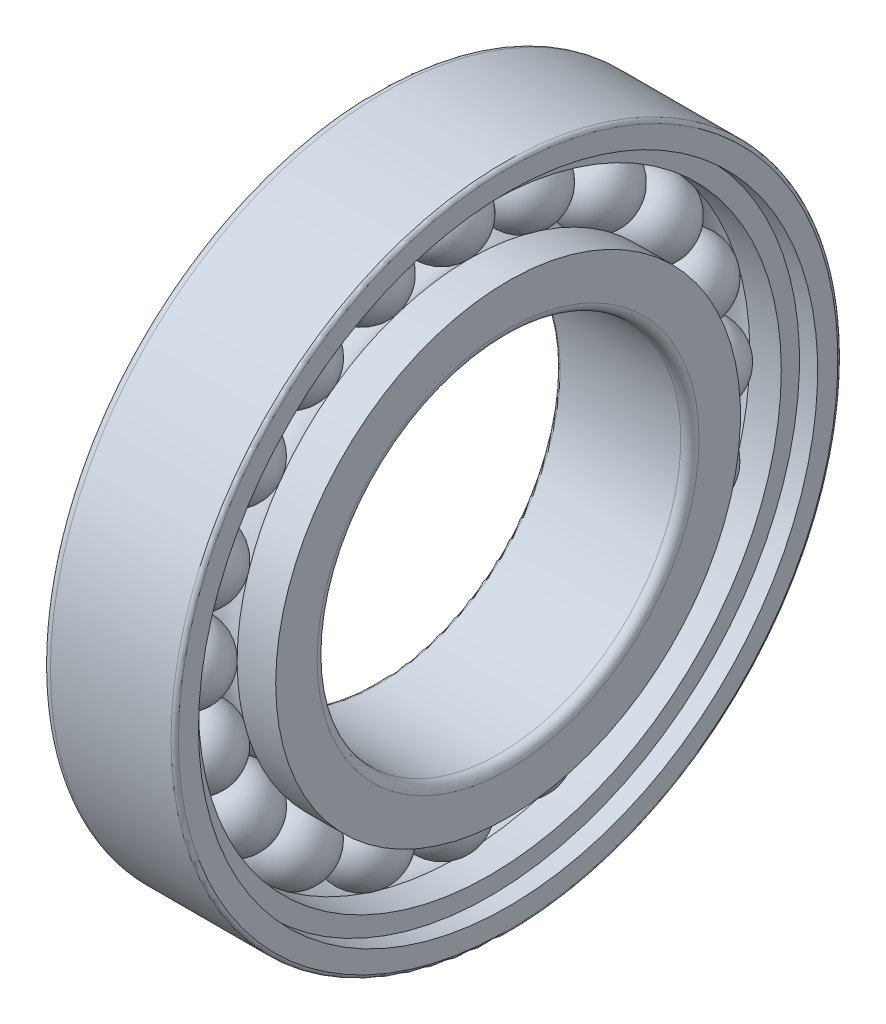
from build123d import *

# Parameters (mm, degrees)
CIRCULAR_PATTERN1_COUNT = 20
FILLET1_R               = 1.5
FILLET2_R               = 0.6


with BuildPart() as part:
    # Sketch1 → Revolve1 (revolve)
    with BuildSketch(Plane.XY):
        with BuildLine():
            Line((-6.25, 42.5), (6.25, 42.5))
            ThreePointArc((6.25, 42.5), (0, 36.25), (-6.25, 42.5))
        make_face()
    revolve1 = revolve(axis=Axis((-3.091912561, 42.5, 0), (1, 0, 0)))

    # Sketch2 → Revolve2 (revolve)
    with BuildSketch(Plane.XY, mode=Mode.PRIVATE) as revolve2_sk:
        with BuildLine():
            Line((-11, 38.333333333), (-4.645049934, 38.333333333))
            ThreePointArc((-4.645049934, 38.333333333), (0, 36.26), (4.645049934, 38.333333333))
            Line((4.645049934, 38.333333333), (11, 38.333333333))
            Line((11, 38.333333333), (11, 30))
            Line((11, 30), (-11, 30))
            Line((-11, 30), (-11, 38.333333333))
        make_face()
    revolve(revolve2_sk.sketch.rotate(Axis((-2.992358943, 0, 0), (1, 0, 0)), 90), axis=Axis((-2.992358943, 0, 0), (1, 0, 0)))

    # Sketch3 → Revolve3 (revolve)
    with BuildSketch(Plane.XY, mode=Mode.PRIVATE) as revolve3_sk:
        with BuildLine():
            Line((-11, 46.666666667), (-11, 55))
            Line((-11, 55), (11, 55))
            Line((11, 55), (11, 51.066666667))
            Line((11, 51.066666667), (8, 51.066666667))
            Line((8, 51.066666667), (8, 48.066666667))
            Line((8, 48.066666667), (2.81954291, 48.066666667))
            ThreePointArc((2.81954291, 48.066666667), (-1.150269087, 48.633064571), (-4.645049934, 46.666666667))
            Line((-4.645049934, 46.666666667), (-11, 46.666666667))
        make_face()
    revolve(revolve3_sk.sketch.rotate(Axis((-2.992358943, 0, 0), (1, 0, 0)), 90), axis=Axis((-2.992358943, 0, 0), (1, 0, 0)))

    # Circular-Pattern1: Revolve1 ×20 about axis
    circular_pattern1_axis = Axis((0, 0, 0), (1, 0, 0))
    for i in range(1, CIRCULAR_PATTERN1_COUNT):
        add(revolve1.rotate(circular_pattern1_axis, i * 360 / CIRCULAR_PATTERN1_COUNT))

    # Fillet1
    fillet1_edges = [part.edges().sort_by_distance(p)[0] for p in [
        (-11, 0, -55),
        (11, 0, -30),
    ]]
    fillet(fillet1_edges, radius=FILLET1_R)

    # Fillet2
    fillet2_edges = [part.edges().sort_by_distance(p)[0] for p in [
        (11, 0, -55),
        (-11, 0, -30),
    ]]
    fillet(fillet2_edges, radius=FILLET2_R)


solid = part.part
